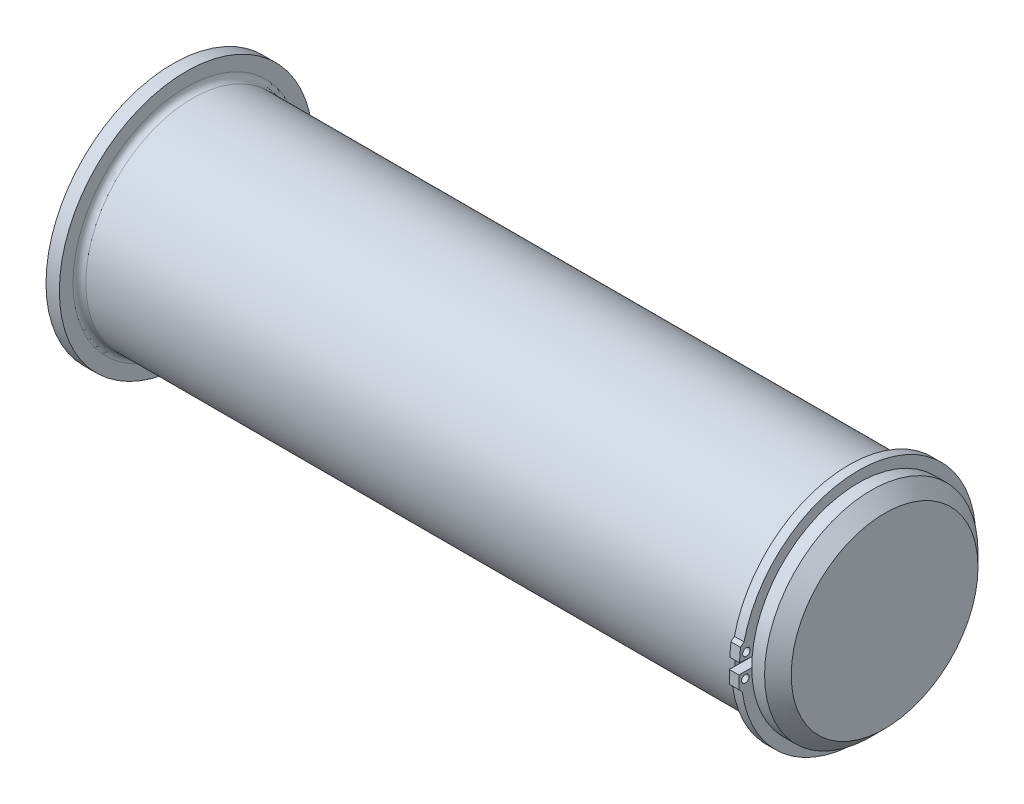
ISO-10303-21;
HEADER;
FILE_DESCRIPTION(('STEP AP214'),'2;1');
FILE_NAME('part.step','',(''),(''),'','','');
FILE_SCHEMA(('AUTOMOTIVE_DESIGN { 1 0 10303 214 1 1 1 1 }'));
ENDSEC;
DATA;
#1=APPLICATION_CONTEXT('core data for automotive mechanical design processes');
#2=APPLICATION_PROTOCOL_DEFINITION('international standard','automotive_design',2000,#1);
#3=PRODUCT_CONTEXT('',#1,'mechanical');
#4=PRODUCT('Part','Part','',(#3));
#5=PRODUCT_RELATED_PRODUCT_CATEGORY('part','',(#4));
#6=PRODUCT_DEFINITION_FORMATION('','',#4);
#7=PRODUCT_DEFINITION_CONTEXT('part definition',#1,'design');
#8=PRODUCT_DEFINITION('design','',#6,#7);
#9=PRODUCT_DEFINITION_SHAPE('','',#8);
#10=(LENGTH_UNIT() NAMED_UNIT(*) SI_UNIT(.MILLI.,.METRE.));
#11=(NAMED_UNIT(*) PLANE_ANGLE_UNIT() SI_UNIT($,.RADIAN.));
#12=(NAMED_UNIT(*) SI_UNIT($,.STERADIAN.) SOLID_ANGLE_UNIT());
#13=UNCERTAINTY_MEASURE_WITH_UNIT(LENGTH_MEASURE(1.E-05),#10,'distance_accuracy_value','');
#14=(GEOMETRIC_REPRESENTATION_CONTEXT(3) GLOBAL_UNCERTAINTY_ASSIGNED_CONTEXT((#13)) GLOBAL_UNIT_ASSIGNED_CONTEXT((#10,
#11,#12)) REPRESENTATION_CONTEXT('',''));
#15=CARTESIAN_POINT('',(0.,0.,0.));
#16=DIRECTION('',(0.,0.,1.));
#17=DIRECTION('',(1.,0.,0.));
#18=AXIS2_PLACEMENT_3D('',#15,#16,#17);
#19=CARTESIAN_POINT('',(0.,0.,0.));
#20=DIRECTION('',(-1.,0.,0.));
#21=DIRECTION('',(0.,0.,1.));
#22=AXIS2_PLACEMENT_3D('',#19,#20,#21);
#23=CYLINDRICAL_SURFACE('',#22,11.049);
#24=CARTESIAN_POINT('',(76.2,0.,0.));
#25=DIRECTION('',(-1.,0.,0.));
#26=DIRECTION('',(0.,0.,1.));
#27=AXIS2_PLACEMENT_3D('',#24,#25,#26);
#28=CIRCLE('',#27,11.049);
#29=CARTESIAN_POINT('',(76.2,0.,11.049));
#30=VERTEX_POINT('',#29);
#31=EDGE_CURVE('E186',#30,#30,#28,.T.);
#32=ORIENTED_EDGE('',*,*,#31,.F.);
#33=EDGE_LOOP('',(#32));
#34=FACE_BOUND('',#33,.T.);
#35=DIRECTION('',(1.,0.,0.));
#36=VECTOR('',#35,1.);
#37=CARTESIAN_POINT('',(77.089,0.962983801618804,11.0069552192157));
#38=LINE('',#37,#36);
#39=CARTESIAN_POINT('',(77.089,0.962983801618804,11.0069552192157));
#40=VERTEX_POINT('',#39);
#41=CARTESIAN_POINT('',(78.232,0.962983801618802,11.0069552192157));
#42=VERTEX_POINT('',#41);
#43=EDGE_CURVE('E53',#40,#42,#38,.T.);
#44=ORIENTED_EDGE('',*,*,#43,.F.);
#45=CARTESIAN_POINT('',(77.089,0.,0.));
#46=DIRECTION('',(1.,0.,0.));
#47=DIRECTION('',(0.,0.,1.));
#48=AXIS2_PLACEMENT_3D('',#45,#46,#47);
#49=CIRCLE('',#48,11.049);
#50=CARTESIAN_POINT('',(77.089,0.,11.049));
#51=VERTEX_POINT('',#50);
#52=EDGE_CURVE('E58',#51,#40,#49,.T.);
#53=ORIENTED_EDGE('',*,*,#52,.F.);
#54=DIRECTION('',(1.,0.,0.));
#55=VECTOR('',#54,1.);
#56=CARTESIAN_POINT('',(77.089,0.,11.049));
#57=LINE('',#56,#55);
#58=CARTESIAN_POINT('',(78.232,0.,11.049));
#59=VERTEX_POINT('',#58);
#60=EDGE_CURVE('E142',#51,#59,#57,.T.);
#61=ORIENTED_EDGE('',*,*,#60,.T.);
#62=CARTESIAN_POINT('',(78.232,0.,0.));
#63=DIRECTION('',(-1.,0.,0.));
#64=DIRECTION('',(0.,0.,1.));
#65=AXIS2_PLACEMENT_3D('',#62,#63,#64);
#66=CIRCLE('',#65,11.049);
#67=EDGE_CURVE('E184',#59,#42,#66,.T.);
#68=ORIENTED_EDGE('',*,*,#67,.T.);
#69=EDGE_LOOP('',(#44,#53,#61,#68));
#70=FACE_BOUND('',#69,.T.);
#71=ADVANCED_FACE('F38',(#34,#70),#23,.T.);
#72=CARTESIAN_POINT('',(78.232,11.049,0.));
#73=DIRECTION('',(1.,0.,0.));
#74=DIRECTION('',(0.,0.,-1.));
#75=AXIS2_PLACEMENT_3D('',#72,#73,#74);
#76=PLANE('',#75);
#77=DIRECTION('',(0.,0.0871557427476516,0.996194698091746));
#78=VECTOR('',#77,1.);
#79=CARTESIAN_POINT('',(78.232,0.962983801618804,11.0069552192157));
#80=LINE('',#79,#78);
#81=CARTESIAN_POINT('',(78.232,1.10687793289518,12.6516726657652));
#82=VERTEX_POINT('',#81);
#83=EDGE_CURVE('E143',#42,#82,#80,.T.);
#84=ORIENTED_EDGE('',*,*,#83,.F.);
#85=ORIENTED_EDGE('',*,*,#67,.F.);
#86=DIRECTION('',(0.,0.,-1.));
#87=VECTOR('',#86,1.);
#88=CARTESIAN_POINT('',(78.232,0.,11.049));
#89=LINE('',#88,#87);
#90=CARTESIAN_POINT('',(78.232,0.,12.7));
#91=VERTEX_POINT('',#90);
#92=EDGE_CURVE('E155',#91,#59,#89,.T.);
#93=ORIENTED_EDGE('',*,*,#92,.F.);
#94=CARTESIAN_POINT('',(78.232,0.,0.));
#95=DIRECTION('',(-1.,0.,0.));
#96=DIRECTION('',(0.,0.,1.));
#97=AXIS2_PLACEMENT_3D('',#94,#95,#96);
#98=CIRCLE('',#97,12.7);
#99=EDGE_CURVE('E181',#91,#82,#98,.T.);
#100=ORIENTED_EDGE('',*,*,#99,.T.);
#101=EDGE_LOOP('',(#84,#85,#93,#100));
#102=FACE_BOUND('',#101,.T.);
#103=ADVANCED_FACE('F228',(#102),#76,.F.);
#104=CARTESIAN_POINT('',(-3.3655,15.0876,0.));
#105=DIRECTION('',(1.,0.,0.));
#106=DIRECTION('',(0.,0.,-1.));
#107=AXIS2_PLACEMENT_3D('',#104,#105,#106);
#108=PLANE('',#107);
#109=CARTESIAN_POINT('',(-3.3655,0.,0.));
#110=DIRECTION('',(-1.,0.,0.));
#111=DIRECTION('',(0.,0.,1.));
#112=AXIS2_PLACEMENT_3D('',#109,#110,#111);
#113=CIRCLE('',#112,15.0876);
#114=CARTESIAN_POINT('',(-3.3655,0.,15.0876));
#115=VERTEX_POINT('',#114);
#116=EDGE_CURVE('E11',#115,#115,#113,.T.);
#117=ORIENTED_EDGE('',*,*,#116,.T.);
#118=EDGE_LOOP('',(#117));
#119=FACE_BOUND('',#118,.T.);
#120=ADVANCED_FACE('F40',(#119),#108,.F.);
#121=CARTESIAN_POINT('',(0.,0.,0.));
#122=DIRECTION('',(-1.,0.,0.));
#123=DIRECTION('',(0.,0.,1.));
#124=AXIS2_PLACEMENT_3D('',#121,#122,#123);
#125=CYLINDRICAL_SURFACE('',#124,15.0876);
#126=ORIENTED_EDGE('',*,*,#116,.F.);
#127=EDGE_LOOP('',(#126));
#128=FACE_BOUND('',#127,.T.);
#129=CARTESIAN_POINT('',(-1.778,0.,0.));
#130=DIRECTION('',(-1.,0.,0.));
#131=DIRECTION('',(0.,0.,1.));
#132=AXIS2_PLACEMENT_3D('',#129,#130,#131);
#133=CIRCLE('',#132,15.0876);
#134=CARTESIAN_POINT('',(-1.778,0.,15.0876));
#135=VERTEX_POINT('',#134);
#136=EDGE_CURVE('E46',#135,#135,#133,.T.);
#137=ORIENTED_EDGE('',*,*,#136,.T.);
#138=EDGE_LOOP('',(#137));
#139=FACE_BOUND('',#138,.T.);
#140=ADVANCED_FACE('F200',(#128,#139),#125,.T.);
#141=CARTESIAN_POINT('',(-1.778,13.462,0.));
#142=DIRECTION('',(-1.,0.,0.));
#143=DIRECTION('',(0.,0.,1.));
#144=AXIS2_PLACEMENT_3D('',#141,#142,#143);
#145=PLANE('',#144);
#146=ORIENTED_EDGE('',*,*,#136,.F.);
#147=EDGE_LOOP('',(#146));
#148=FACE_BOUND('',#147,.T.);
#149=CARTESIAN_POINT('',(-1.778,0.,0.));
#150=DIRECTION('',(-1.,0.,0.));
#151=DIRECTION('',(0.,0.,1.));
#152=AXIS2_PLACEMENT_3D('',#149,#150,#151);
#153=CIRCLE('',#152,13.462);
#154=CARTESIAN_POINT('',(-1.778,0.,13.462));
#155=VERTEX_POINT('',#154);
#156=EDGE_CURVE('E195',#155,#155,#153,.T.);
#157=ORIENTED_EDGE('',*,*,#156,.T.);
#158=EDGE_LOOP('',(#157));
#159=FACE_BOUND('',#158,.T.);
#160=ADVANCED_FACE('F202',(#148,#159),#145,.F.);
#161=CARTESIAN_POINT('',(-1.016,0.,0.));
#162=DIRECTION('',(-1.,0.,0.));
#163=DIRECTION('',(0.,0.,1.));
#164=AXIS2_PLACEMENT_3D('',#161,#162,#163);
#165=TOROIDAL_SURFACE('',#164,13.462,0.762);
#166=ORIENTED_EDGE('',*,*,#156,.F.);
#167=EDGE_LOOP('',(#166));
#168=FACE_BOUND('',#167,.T.);
#169=CARTESIAN_POINT('',(-1.01599999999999,0.,0.));
#170=DIRECTION('',(-1.,0.,0.));
#171=DIRECTION('',(0.,0.,1.));
#172=AXIS2_PLACEMENT_3D('',#169,#170,#171);
#173=CIRCLE('',#172,12.7);
#174=CARTESIAN_POINT('',(-1.01599999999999,0.,12.7));
#175=VERTEX_POINT('',#174);
#176=EDGE_CURVE('E192',#175,#175,#173,.T.);
#177=ORIENTED_EDGE('',*,*,#176,.T.);
#178=EDGE_LOOP('',(#177));
#179=FACE_BOUND('',#178,.T.);
#180=ADVANCED_FACE('F205',(#168,#179),#165,.F.);
#181=CARTESIAN_POINT('',(0.,0.,0.));
#182=DIRECTION('',(-1.,0.,0.));
#183=DIRECTION('',(0.,0.,1.));
#184=AXIS2_PLACEMENT_3D('',#181,#182,#183);
#185=CYLINDRICAL_SURFACE('',#184,12.7);
#186=ORIENTED_EDGE('',*,*,#176,.F.);
#187=EDGE_LOOP('',(#186));
#188=FACE_BOUND('',#187,.T.);
#189=CARTESIAN_POINT('',(76.2,0.,0.));
#190=DIRECTION('',(-1.,0.,0.));
#191=DIRECTION('',(0.,0.,1.));
#192=AXIS2_PLACEMENT_3D('',#189,#190,#191);
#193=CIRCLE('',#192,12.7);
#194=CARTESIAN_POINT('',(76.2,0.,12.7));
#195=VERTEX_POINT('',#194);
#196=EDGE_CURVE('E189',#195,#195,#193,.T.);
#197=ORIENTED_EDGE('',*,*,#196,.T.);
#198=EDGE_LOOP('',(#197));
#199=FACE_BOUND('',#198,.T.);
#200=ADVANCED_FACE('F211',(#188,#199),#185,.T.);
#201=CARTESIAN_POINT('',(76.2,12.7,0.));
#202=DIRECTION('',(-1.,0.,0.));
#203=DIRECTION('',(0.,0.,1.));
#204=AXIS2_PLACEMENT_3D('',#201,#202,#203);
#205=PLANE('',#204);
#206=ORIENTED_EDGE('',*,*,#196,.F.);
#207=EDGE_LOOP('',(#206));
#208=FACE_BOUND('',#207,.T.);
#209=ORIENTED_EDGE('',*,*,#31,.T.);
#210=EDGE_LOOP('',(#209));
#211=FACE_BOUND('',#210,.T.);
#212=ADVANCED_FACE('F217',(#208,#211),#205,.F.);
#213=CARTESIAN_POINT('',(0.,0.,0.));
#214=DIRECTION('',(-1.,0.,0.));
#215=DIRECTION('',(0.,0.,1.));
#216=AXIS2_PLACEMENT_3D('',#213,#214,#215);
#217=CYLINDRICAL_SURFACE('',#216,12.7);
#218=ORIENTED_EDGE('',*,*,#99,.F.);
#219=EDGE_CURVE('E180',#82,#91,#98,.T.);
#220=ORIENTED_EDGE('',*,*,#219,.F.);
#221=EDGE_LOOP('',(#218,#220));
#222=FACE_BOUND('',#221,.T.);
#223=CARTESIAN_POINT('',(79.756,0.,0.));
#224=DIRECTION('',(-1.,0.,0.));
#225=DIRECTION('',(0.,0.,1.));
#226=AXIS2_PLACEMENT_3D('',#223,#224,#225);
#227=CIRCLE('',#226,12.7);
#228=CARTESIAN_POINT('',(79.756,0.,12.7));
#229=VERTEX_POINT('',#228);
#230=EDGE_CURVE('E177',#229,#229,#227,.T.);
#231=ORIENTED_EDGE('',*,*,#230,.T.);
#232=EDGE_LOOP('',(#231));
#233=FACE_BOUND('',#232,.T.);
#234=ADVANCED_FACE('F223',(#222,#233),#217,.T.);
#235=CARTESIAN_POINT('',(81.3435,0.,0.));
#236=DIRECTION('',(-1.,0.,0.));
#237=DIRECTION('',(0.,0.,1.));
#238=AXIS2_PLACEMENT_3D('',#235,#236,#237);
#239=CONICAL_SURFACE('',#238,11.1125,0.785398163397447);
#240=ORIENTED_EDGE('',*,*,#230,.F.);
#241=EDGE_LOOP('',(#240));
#242=FACE_BOUND('',#241,.T.);
#243=CARTESIAN_POINT('',(81.3435,0.,0.));
#244=DIRECTION('',(-1.,0.,0.));
#245=DIRECTION('',(0.,0.,1.));
#246=AXIS2_PLACEMENT_3D('',#243,#244,#245);
#247=CIRCLE('',#246,11.1125);
#248=CARTESIAN_POINT('',(81.3435,0.,11.1125));
#249=VERTEX_POINT('',#248);
#250=EDGE_CURVE('E174',#249,#249,#247,.T.);
#251=ORIENTED_EDGE('',*,*,#250,.T.);
#252=EDGE_LOOP('',(#251));
#253=FACE_BOUND('',#252,.T.);
#254=ADVANCED_FACE('F262',(#242,#253),#239,.T.);
#255=CARTESIAN_POINT('',(81.3435,11.1125,0.));
#256=DIRECTION('',(-1.,0.,0.));
#257=DIRECTION('',(0.,0.,1.));
#258=AXIS2_PLACEMENT_3D('',#255,#256,#257);
#259=PLANE('',#258);
#260=ORIENTED_EDGE('',*,*,#250,.F.);
#261=EDGE_LOOP('',(#260));
#262=FACE_BOUND('',#261,.T.);
#263=ADVANCED_FACE('F275',(#262),#259,.F.);
#264=CARTESIAN_POINT('',(77.089,0.,0.));
#265=DIRECTION('',(-1.,0.,0.));
#266=DIRECTION('',(0.,0.,1.));
#267=AXIS2_PLACEMENT_3D('',#264,#265,#266);
#268=PLANE('',#267);
#269=CARTESIAN_POINT('',(77.089,1.9323909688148,13.3443603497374));
#270=DIRECTION('',(-1.,0.,0.));
#271=DIRECTION('',(0.,0.,1.));
#272=AXIS2_PLACEMENT_3D('',#269,#270,#271);
#273=CIRCLE('',#272,0.4445);
#274=CARTESIAN_POINT('',(77.089,1.9323909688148,13.7888603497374));
#275=VERTEX_POINT('',#274);
#276=EDGE_CURVE('E437',#275,#275,#273,.T.);
#277=ORIENTED_EDGE('',*,*,#276,.F.);
#278=EDGE_LOOP('',(#277));
#279=FACE_BOUND('',#278,.T.);
#280=ORIENTED_EDGE('',*,*,#52,.T.);
#281=DIRECTION('',(0.,0.0871557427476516,0.996194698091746));
#282=VECTOR('',#281,1.);
#283=CARTESIAN_POINT('',(77.089,0.962983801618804,11.0069552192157));
#284=LINE('',#283,#282);
#285=CARTESIAN_POINT('',(77.089,1.2397032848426,14.169873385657));
#286=VERTEX_POINT('',#285);
#287=EDGE_CURVE('E107',#40,#286,#284,.T.);
#288=ORIENTED_EDGE('',*,*,#287,.T.);
#289=DIRECTION('',(0.,0.996194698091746,-0.0871557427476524));
#290=VECTOR('',#289,1.);
#291=CARTESIAN_POINT('',(77.089,1.2397032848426,14.169873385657));
#292=LINE('',#291,#290);
#293=CARTESIAN_POINT('',(77.089,2.75790400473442,14.0370480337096));
#294=VERTEX_POINT('',#293);
#295=EDGE_CURVE('E112',#286,#294,#292,.T.);
#296=ORIENTED_EDGE('',*,*,#295,.T.);
#297=DIRECTION('',(0.,0.64278760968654,-0.766044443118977));
#298=VECTOR('',#297,1.);
#299=CARTESIAN_POINT('',(77.089,2.75790400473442,14.0370480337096));
#300=LINE('',#299,#298);
#301=CARTESIAN_POINT('',(77.089,3.107933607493,13.6198989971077));
#302=VERTEX_POINT('',#301);
#303=EDGE_CURVE('E129',#294,#302,#300,.T.);
#304=ORIENTED_EDGE('',*,*,#303,.T.);
#305=CARTESIAN_POINT('',(77.089,0.,0.));
#306=DIRECTION('',(-1.,0.,0.));
#307=DIRECTION('',(0.,0.,1.));
#308=AXIS2_PLACEMENT_3D('',#305,#306,#307);
#309=CIRCLE('',#308,13.97);
#310=CARTESIAN_POINT('',(77.089,-1.90905456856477,13.8389454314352));
#311=VERTEX_POINT('',#310);
#312=EDGE_CURVE('E131',#302,#311,#309,.T.);
#313=ORIENTED_EDGE('',*,*,#312,.T.);
#314=DIRECTION('',(0.,0.707106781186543,0.707106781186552));
#315=VECTOR('',#314,1.);
#316=CARTESIAN_POINT('',(77.089,-1.524,14.224));
#317=LINE('',#316,#315);
#318=CARTESIAN_POINT('',(77.089,-1.524,14.224));
#319=VERTEX_POINT('',#318);
#320=EDGE_CURVE('E136',#311,#319,#317,.T.);
#321=ORIENTED_EDGE('',*,*,#320,.T.);
#322=DIRECTION('',(0.,1.,0.));
#323=VECTOR('',#322,1.);
#324=CARTESIAN_POINT('',(77.089,0.,14.224));
#325=LINE('',#324,#323);
#326=CARTESIAN_POINT('',(77.089,0.,14.224));
#327=VERTEX_POINT('',#326);
#328=EDGE_CURVE('E138',#319,#327,#325,.T.);
#329=ORIENTED_EDGE('',*,*,#328,.T.);
#330=DIRECTION('',(0.,0.,-1.));
#331=VECTOR('',#330,1.);
#332=CARTESIAN_POINT('',(77.089,0.,11.049));
#333=LINE('',#332,#331);
#334=EDGE_CURVE('E140',#327,#51,#333,.T.);
#335=ORIENTED_EDGE('',*,*,#334,.T.);
#336=EDGE_LOOP('',(#280,#288,#296,#304,#313,#321,#329,#335));
#337=FACE_BOUND('',#336,.T.);
#338=CARTESIAN_POINT('',(77.089,-0.762,13.462));
#339=DIRECTION('',(-1.,0.,0.));
#340=DIRECTION('',(0.,0.,1.));
#341=AXIS2_PLACEMENT_3D('',#338,#339,#340);
#342=CIRCLE('',#341,0.4445);
#343=CARTESIAN_POINT('',(77.089,-0.762,13.9065));
#344=VERTEX_POINT('',#343);
#345=EDGE_CURVE('E428',#344,#344,#342,.T.);
#346=ORIENTED_EDGE('',*,*,#345,.F.);
#347=EDGE_LOOP('',(#346));
#348=FACE_BOUND('',#347,.T.);
#349=ADVANCED_FACE('F109',(#279,#337,#348),#268,.T.);
#350=CARTESIAN_POINT('',(78.232,0.,0.));
#351=DIRECTION('',(-1.,0.,0.));
#352=DIRECTION('',(0.,0.,1.));
#353=AXIS2_PLACEMENT_3D('',#350,#351,#352);
#354=PLANE('',#353);
#355=CARTESIAN_POINT('',(78.232,1.2397032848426,14.169873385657));
#356=VERTEX_POINT('',#355);
#357=EDGE_CURVE('E121',#82,#356,#80,.T.);
#358=ORIENTED_EDGE('',*,*,#357,.F.);
#359=ORIENTED_EDGE('',*,*,#219,.T.);
#360=CARTESIAN_POINT('',(78.232,0.,14.224));
#361=VERTEX_POINT('',#360);
#362=EDGE_CURVE('E156',#361,#91,#89,.T.);
#363=ORIENTED_EDGE('',*,*,#362,.F.);
#364=DIRECTION('',(0.,1.,0.));
#365=VECTOR('',#364,1.);
#366=CARTESIAN_POINT('',(78.232,0.,14.224));
#367=LINE('',#366,#365);
#368=CARTESIAN_POINT('',(78.232,-1.524,14.224));
#369=VERTEX_POINT('',#368);
#370=EDGE_CURVE('E153',#369,#361,#367,.T.);
#371=ORIENTED_EDGE('',*,*,#370,.F.);
#372=DIRECTION('',(0.,0.707106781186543,0.707106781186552));
#373=VECTOR('',#372,1.);
#374=CARTESIAN_POINT('',(78.232,-1.524,14.224));
#375=LINE('',#374,#373);
#376=CARTESIAN_POINT('',(78.232,-1.90905456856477,13.8389454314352));
#377=VERTEX_POINT('',#376);
#378=EDGE_CURVE('E151',#377,#369,#375,.T.);
#379=ORIENTED_EDGE('',*,*,#378,.F.);
#380=CARTESIAN_POINT('',(78.232,0.,0.));
#381=DIRECTION('',(-1.,0.,0.));
#382=DIRECTION('',(0.,0.,1.));
#383=AXIS2_PLACEMENT_3D('',#380,#381,#382);
#384=CIRCLE('',#383,13.97);
#385=CARTESIAN_POINT('',(78.232,3.107933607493,13.6198989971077));
#386=VERTEX_POINT('',#385);
#387=EDGE_CURVE('E149',#386,#377,#384,.T.);
#388=ORIENTED_EDGE('',*,*,#387,.F.);
#389=DIRECTION('',(0.,0.64278760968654,-0.766044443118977));
#390=VECTOR('',#389,1.);
#391=CARTESIAN_POINT('',(78.232,2.75790400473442,14.0370480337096));
#392=LINE('',#391,#390);
#393=CARTESIAN_POINT('',(78.232,2.75790400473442,14.0370480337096));
#394=VERTEX_POINT('',#393);
#395=EDGE_CURVE('E147',#394,#386,#392,.T.);
#396=ORIENTED_EDGE('',*,*,#395,.F.);
#397=DIRECTION('',(0.,0.996194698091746,-0.0871557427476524));
#398=VECTOR('',#397,1.);
#399=CARTESIAN_POINT('',(78.232,1.2397032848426,14.169873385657));
#400=LINE('',#399,#398);
#401=EDGE_CURVE('E145',#356,#394,#400,.T.);
#402=ORIENTED_EDGE('',*,*,#401,.F.);
#403=EDGE_LOOP('',(#358,#359,#363,#371,#379,#388,#396,#402));
#404=FACE_BOUND('',#403,.T.);
#405=CARTESIAN_POINT('',(78.232,1.9323909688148,13.3443603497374));
#406=DIRECTION('',(-1.,0.,0.));
#407=DIRECTION('',(0.,0.,1.));
#408=AXIS2_PLACEMENT_3D('',#405,#406,#407);
#409=CIRCLE('',#408,0.4445);
#410=CARTESIAN_POINT('',(78.232,1.9323909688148,13.7888603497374));
#411=VERTEX_POINT('',#410);
#412=EDGE_CURVE('E434',#411,#411,#409,.T.);
#413=ORIENTED_EDGE('',*,*,#412,.T.);
#414=EDGE_LOOP('',(#413));
#415=FACE_BOUND('',#414,.T.);
#416=CARTESIAN_POINT('',(78.232,-0.762,13.462));
#417=DIRECTION('',(-1.,0.,0.));
#418=DIRECTION('',(0.,0.,1.));
#419=AXIS2_PLACEMENT_3D('',#416,#417,#418);
#420=CIRCLE('',#419,0.4445);
#421=CARTESIAN_POINT('',(78.232,-0.762,13.9065));
#422=VERTEX_POINT('',#421);
#423=EDGE_CURVE('E431',#422,#422,#420,.T.);
#424=ORIENTED_EDGE('',*,*,#423,.T.);
#425=EDGE_LOOP('',(#424));
#426=FACE_BOUND('',#425,.T.);
#427=ADVANCED_FACE('F274',(#404,#415,#426),#354,.F.);
#428=CARTESIAN_POINT('',(77.089,0.962983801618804,11.0069552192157));
#429=DIRECTION('',(0.,0.996194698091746,-0.0871557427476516));
#430=DIRECTION('',(0.,0.0871557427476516,0.996194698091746));
#431=AXIS2_PLACEMENT_3D('',#428,#429,#430);
#432=PLANE('',#431);
#433=ORIENTED_EDGE('',*,*,#83,.T.);
#434=ORIENTED_EDGE('',*,*,#357,.T.);
#435=DIRECTION('',(1.,0.,0.));
#436=VECTOR('',#435,1.);
#437=CARTESIAN_POINT('',(77.089,1.2397032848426,14.169873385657));
#438=LINE('',#437,#436);
#439=EDGE_CURVE('E117',#286,#356,#438,.T.);
#440=ORIENTED_EDGE('',*,*,#439,.F.);
#441=ORIENTED_EDGE('',*,*,#287,.F.);
#442=ORIENTED_EDGE('',*,*,#43,.T.);
#443=EDGE_LOOP('',(#433,#434,#440,#441,#442));
#444=FACE_BOUND('',#443,.T.);
#445=ADVANCED_FACE('F119',(#444),#432,.F.);
#446=CARTESIAN_POINT('',(77.089,1.2397032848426,14.169873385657));
#447=DIRECTION('',(0.,-0.0871557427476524,-0.996194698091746));
#448=DIRECTION('',(0.,0.996194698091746,-0.0871557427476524));
#449=AXIS2_PLACEMENT_3D('',#446,#447,#448);
#450=PLANE('',#449);
#451=ORIENTED_EDGE('',*,*,#401,.T.);
#452=DIRECTION('',(1.,0.,0.));
#453=VECTOR('',#452,1.);
#454=CARTESIAN_POINT('',(77.089,2.75790400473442,14.0370480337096));
#455=LINE('',#454,#453);
#456=EDGE_CURVE('E124',#294,#394,#455,.T.);
#457=ORIENTED_EDGE('',*,*,#456,.F.);
#458=ORIENTED_EDGE('',*,*,#295,.F.);
#459=ORIENTED_EDGE('',*,*,#439,.T.);
#460=EDGE_LOOP('',(#451,#457,#458,#459));
#461=FACE_BOUND('',#460,.T.);
#462=ADVANCED_FACE('F126',(#461),#450,.F.);
#463=CARTESIAN_POINT('',(77.089,2.75790400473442,14.0370480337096));
#464=DIRECTION('',(0.,-0.766044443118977,-0.64278760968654));
#465=DIRECTION('',(0.,0.64278760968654,-0.766044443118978));
#466=AXIS2_PLACEMENT_3D('',#463,#464,#465);
#467=PLANE('',#466);
#468=ORIENTED_EDGE('',*,*,#395,.T.);
#469=DIRECTION('',(1.,0.,0.));
#470=VECTOR('',#469,1.);
#471=CARTESIAN_POINT('',(77.089,3.107933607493,13.6198989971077));
#472=LINE('',#471,#470);
#473=EDGE_CURVE('E169',#302,#386,#472,.T.);
#474=ORIENTED_EDGE('',*,*,#473,.F.);
#475=ORIENTED_EDGE('',*,*,#303,.F.);
#476=ORIENTED_EDGE('',*,*,#456,.T.);
#477=EDGE_LOOP('',(#468,#474,#475,#476));
#478=FACE_BOUND('',#477,.T.);
#479=ADVANCED_FACE('F303',(#478),#467,.F.);
#480=CARTESIAN_POINT('',(77.089,0.,0.));
#481=DIRECTION('',(1.,0.,0.));
#482=DIRECTION('',(0.,0.,-1.));
#483=AXIS2_PLACEMENT_3D('',#480,#481,#482);
#484=CYLINDRICAL_SURFACE('',#483,13.97);
#485=ORIENTED_EDGE('',*,*,#387,.T.);
#486=DIRECTION('',(1.,0.,0.));
#487=VECTOR('',#486,1.);
#488=CARTESIAN_POINT('',(77.089,-1.90905456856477,13.8389454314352));
#489=LINE('',#488,#487);
#490=EDGE_CURVE('E166',#311,#377,#489,.T.);
#491=ORIENTED_EDGE('',*,*,#490,.F.);
#492=ORIENTED_EDGE('',*,*,#312,.F.);
#493=ORIENTED_EDGE('',*,*,#473,.T.);
#494=EDGE_LOOP('',(#485,#491,#492,#493));
#495=FACE_BOUND('',#494,.T.);
#496=ADVANCED_FACE('F312',(#495),#484,.T.);
#497=CARTESIAN_POINT('',(77.089,-1.524,14.224));
#498=DIRECTION('',(0.,0.707106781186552,-0.707106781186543));
#499=DIRECTION('',(0.,0.707106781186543,0.707106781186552));
#500=AXIS2_PLACEMENT_3D('',#497,#498,#499);
#501=PLANE('',#500);
#502=ORIENTED_EDGE('',*,*,#378,.T.);
#503=DIRECTION('',(1.,0.,0.));
#504=VECTOR('',#503,1.);
#505=CARTESIAN_POINT('',(77.089,-1.524,14.224));
#506=LINE('',#505,#504);
#507=EDGE_CURVE('E163',#319,#369,#506,.T.);
#508=ORIENTED_EDGE('',*,*,#507,.F.);
#509=ORIENTED_EDGE('',*,*,#320,.F.);
#510=ORIENTED_EDGE('',*,*,#490,.T.);
#511=EDGE_LOOP('',(#502,#508,#509,#510));
#512=FACE_BOUND('',#511,.T.);
#513=ADVANCED_FACE('F322',(#512),#501,.F.);
#514=CARTESIAN_POINT('',(77.089,0.,14.224));
#515=DIRECTION('',(0.,0.,-1.));
#516=DIRECTION('',(-1.,0.,0.));
#517=AXIS2_PLACEMENT_3D('',#514,#515,#516);
#518=PLANE('',#517);
#519=ORIENTED_EDGE('',*,*,#370,.T.);
#520=DIRECTION('',(1.,0.,0.));
#521=VECTOR('',#520,1.);
#522=CARTESIAN_POINT('',(77.089,0.,14.224));
#523=LINE('',#522,#521);
#524=EDGE_CURVE('E160',#327,#361,#523,.T.);
#525=ORIENTED_EDGE('',*,*,#524,.F.);
#526=ORIENTED_EDGE('',*,*,#328,.F.);
#527=ORIENTED_EDGE('',*,*,#507,.T.);
#528=EDGE_LOOP('',(#519,#525,#526,#527));
#529=FACE_BOUND('',#528,.T.);
#530=ADVANCED_FACE('F332',(#529),#518,.F.);
#531=CARTESIAN_POINT('',(77.089,0.,11.049));
#532=DIRECTION('',(0.,-1.,0.));
#533=DIRECTION('',(0.,0.,-1.));
#534=AXIS2_PLACEMENT_3D('',#531,#532,#533);
#535=PLANE('',#534);
#536=ORIENTED_EDGE('',*,*,#362,.T.);
#537=ORIENTED_EDGE('',*,*,#92,.T.);
#538=ORIENTED_EDGE('',*,*,#60,.F.);
#539=ORIENTED_EDGE('',*,*,#334,.F.);
#540=ORIENTED_EDGE('',*,*,#524,.T.);
#541=EDGE_LOOP('',(#536,#537,#538,#539,#540));
#542=FACE_BOUND('',#541,.T.);
#543=ADVANCED_FACE('F342',(#542),#535,.F.);
#544=CARTESIAN_POINT('',(77.089,1.9323909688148,13.3443603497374));
#545=DIRECTION('',(1.,0.,0.));
#546=DIRECTION('',(0.,0.,-1.));
#547=AXIS2_PLACEMENT_3D('',#544,#545,#546);
#548=CYLINDRICAL_SURFACE('',#547,0.4445);
#549=ORIENTED_EDGE('',*,*,#276,.T.);
#550=EDGE_LOOP('',(#549));
#551=FACE_BOUND('',#550,.T.);
#552=ORIENTED_EDGE('',*,*,#412,.F.);
#553=EDGE_LOOP('',(#552));
#554=FACE_BOUND('',#553,.T.);
#555=ADVANCED_FACE('F352',(#551,#554),#548,.F.);
#556=CARTESIAN_POINT('',(77.089,-0.762,13.462));
#557=DIRECTION('',(1.,0.,0.));
#558=DIRECTION('',(0.,0.,-1.));
#559=AXIS2_PLACEMENT_3D('',#556,#557,#558);
#560=CYLINDRICAL_SURFACE('',#559,0.4445);
#561=ORIENTED_EDGE('',*,*,#345,.T.);
#562=EDGE_LOOP('',(#561));
#563=FACE_BOUND('',#562,.T.);
#564=ORIENTED_EDGE('',*,*,#423,.F.);
#565=EDGE_LOOP('',(#564));
#566=FACE_BOUND('',#565,.T.);
#567=ADVANCED_FACE('F362',(#563,#566),#560,.F.);
#568=CLOSED_SHELL('',(#71,#103,#120,#140,#160,#180,#200,#212,#234,#254,#263,#349,#427,#445,#462,
#479,#496,#513,#530,#543,#555,#567));
#569=MANIFOLD_SOLID_BREP('B2',#568);
#570=ADVANCED_BREP_SHAPE_REPRESENTATION('',(#18,#569),#14);
#571=SHAPE_DEFINITION_REPRESENTATION(#9,#570);
ENDSEC;
END-ISO-10303-21;
